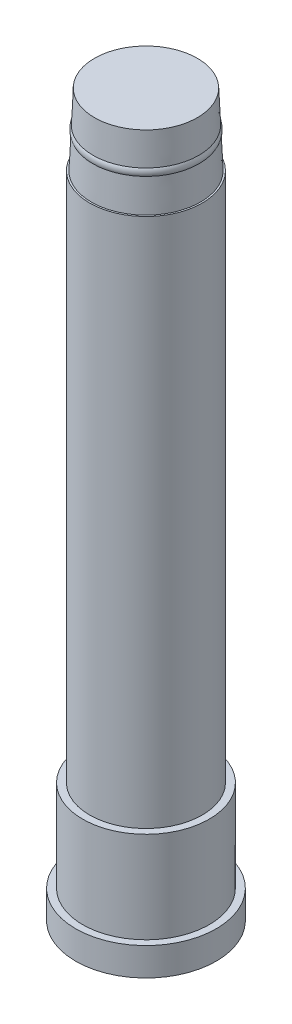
ISO-10303-21;
HEADER;
FILE_DESCRIPTION(('STEP AP214'),'2;1');
FILE_NAME('part.step','',(''),(''),'','','');
FILE_SCHEMA(('AUTOMOTIVE_DESIGN { 1 0 10303 214 1 1 1 1 }'));
ENDSEC;
DATA;
#1=APPLICATION_CONTEXT('core data for automotive mechanical design processes');
#2=APPLICATION_PROTOCOL_DEFINITION('international standard','automotive_design',2000,#1);
#3=PRODUCT_CONTEXT('',#1,'mechanical');
#4=PRODUCT('Part','Part','',(#3));
#5=PRODUCT_RELATED_PRODUCT_CATEGORY('part','',(#4));
#6=PRODUCT_DEFINITION_FORMATION('','',#4);
#7=PRODUCT_DEFINITION_CONTEXT('part definition',#1,'design');
#8=PRODUCT_DEFINITION('design','',#6,#7);
#9=PRODUCT_DEFINITION_SHAPE('','',#8);
#10=(LENGTH_UNIT() NAMED_UNIT(*) SI_UNIT(.MILLI.,.METRE.));
#11=(NAMED_UNIT(*) PLANE_ANGLE_UNIT() SI_UNIT($,.RADIAN.));
#12=(NAMED_UNIT(*) SI_UNIT($,.STERADIAN.) SOLID_ANGLE_UNIT());
#13=UNCERTAINTY_MEASURE_WITH_UNIT(LENGTH_MEASURE(1.E-05),#10,'distance_accuracy_value','');
#14=(GEOMETRIC_REPRESENTATION_CONTEXT(3) GLOBAL_UNCERTAINTY_ASSIGNED_CONTEXT((#13)) GLOBAL_UNIT_ASSIGNED_CONTEXT((#10,
#11,#12)) REPRESENTATION_CONTEXT('',''));
#15=CARTESIAN_POINT('',(0.,0.,0.));
#16=DIRECTION('',(0.,0.,1.));
#17=DIRECTION('',(1.,0.,0.));
#18=AXIS2_PLACEMENT_3D('',#15,#16,#17);
#19=CARTESIAN_POINT('',(0.,49.4323076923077,0.));
#20=DIRECTION('',(0.,1.,0.));
#21=DIRECTION('',(0.,0.,1.));
#22=AXIS2_PLACEMENT_3D('',#19,#20,#21);
#23=CYLINDRICAL_SURFACE('',#22,7.99999999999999);
#24=CARTESIAN_POINT('',(0.,17.,0.));
#25=DIRECTION('',(0.,1.,0.));
#26=DIRECTION('',(0.,0.,1.));
#27=AXIS2_PLACEMENT_3D('',#24,#25,#26);
#28=CIRCLE('',#27,7.99999999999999);
#29=CARTESIAN_POINT('',(0.,17.,7.99999999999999));
#30=VERTEX_POINT('',#29);
#31=EDGE_CURVE('E10',#30,#30,#28,.F.);
#32=ORIENTED_EDGE('',*,*,#31,.F.);
#33=EDGE_LOOP('',(#32));
#34=FACE_BOUND('',#33,.T.);
#35=CARTESIAN_POINT('',(0.,92.383,0.));
#36=DIRECTION('',(0.,1.,0.));
#37=DIRECTION('',(0.,0.,1.));
#38=AXIS2_PLACEMENT_3D('',#35,#36,#37);
#39=CIRCLE('',#38,7.99999999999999);
#40=CARTESIAN_POINT('',(0.,92.383,7.99999999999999));
#41=VERTEX_POINT('',#40);
#42=EDGE_CURVE('E48',#41,#41,#39,.F.);
#43=ORIENTED_EDGE('',*,*,#42,.T.);
#44=EDGE_LOOP('',(#43));
#45=FACE_BOUND('',#44,.T.);
#46=ADVANCED_FACE('F32',(#34,#45),#23,.T.);
#47=CARTESIAN_POINT('',(0.,92.383,9.671));
#48=DIRECTION('',(0.,1.,0.));
#49=DIRECTION('',(1.,0.,0.));
#50=AXIS2_PLACEMENT_3D('',#47,#48,#49);
#51=PLANE('',#50);
#52=ORIENTED_EDGE('',*,*,#42,.F.);
#53=EDGE_LOOP('',(#52));
#54=FACE_BOUND('',#53,.T.);
#55=CARTESIAN_POINT('',(0.,92.383,0.));
#56=DIRECTION('',(0.,-1.,0.));
#57=DIRECTION('',(-1.,0.,0.));
#58=AXIS2_PLACEMENT_3D('',#55,#56,#57);
#59=CIRCLE('',#58,7.76225);
#60=CARTESIAN_POINT('',(-7.76225,92.383,0.));
#61=VERTEX_POINT('',#60);
#62=EDGE_CURVE('E52',#61,#61,#59,.T.);
#63=ORIENTED_EDGE('',*,*,#62,.T.);
#64=EDGE_LOOP('',(#63));
#65=FACE_BOUND('',#64,.T.);
#66=ADVANCED_FACE('F94',(#54,#65),#51,.T.);
#67=CARTESIAN_POINT('',(0.,92.383,0.));
#68=DIRECTION('',(0.,-1.,0.));
#69=DIRECTION('',(-1.,0.,0.));
#70=AXIS2_PLACEMENT_3D('',#67,#68,#69);
#71=CONICAL_SURFACE('',#70,7.76225,0.0436332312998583);
#72=CARTESIAN_POINT('',(0.,97.0101830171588,0.));
#73=DIRECTION('',(0.,1.,0.));
#74=DIRECTION('',(1.,0.,0.));
#75=AXIS2_PLACEMENT_3D('',#72,#73,#74);
#76=CIRCLE('',#75,7.56022282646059);
#77=CARTESIAN_POINT('',(7.56022282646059,97.0101830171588,0.));
#78=VERTEX_POINT('',#77);
#79=EDGE_CURVE('E60',#78,#78,#76,.T.);
#80=ORIENTED_EDGE('',*,*,#79,.F.);
#81=EDGE_LOOP('',(#80));
#82=FACE_BOUND('',#81,.T.);
#83=ORIENTED_EDGE('',*,*,#62,.F.);
#84=EDGE_LOOP('',(#83));
#85=FACE_BOUND('',#84,.T.);
#86=ADVANCED_FACE('F99',(#82,#85),#71,.T.);
#87=CARTESIAN_POINT('',(0.,97.473,0.));
#88=DIRECTION('',(0.,1.,0.));
#89=DIRECTION('',(1.,0.,0.));
#90=AXIS2_PLACEMENT_3D('',#87,#88,#89);
#91=TOROIDAL_SURFACE('',#90,6.65351204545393,1.018);
#92=ORIENTED_EDGE('',*,*,#79,.T.);
#93=EDGE_LOOP('',(#92));
#94=FACE_BOUND('',#93,.T.);
#95=CARTESIAN_POINT('',(0.,98.0130808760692,0.));
#96=DIRECTION('',(0.,1.,0.));
#97=DIRECTION('',(1.,0.,0.));
#98=AXIS2_PLACEMENT_3D('',#95,#96,#97);
#99=CIRCLE('',#98,7.51643536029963);
#100=CARTESIAN_POINT('',(7.51643536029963,98.0130808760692,0.));
#101=VERTEX_POINT('',#100);
#102=EDGE_CURVE('E65',#101,#101,#99,.T.);
#103=ORIENTED_EDGE('',*,*,#102,.F.);
#104=EDGE_LOOP('',(#103));
#105=FACE_BOUND('',#104,.T.);
#106=ADVANCED_FACE('F105',(#94,#105),#91,.T.);
#107=CARTESIAN_POINT('',(0.,102.563,7.31778160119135));
#108=DIRECTION('',(0.,1.,0.));
#109=DIRECTION('',(1.,0.,0.));
#110=AXIS2_PLACEMENT_3D('',#107,#108,#109);
#111=PLANE('',#110);
#112=CARTESIAN_POINT('',(0.,102.563,0.));
#113=DIRECTION('',(0.,-1.,0.));
#114=DIRECTION('',(-1.,0.,0.));
#115=AXIS2_PLACEMENT_3D('',#112,#113,#114);
#116=CIRCLE('',#115,7.31778160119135);
#117=CARTESIAN_POINT('',(-7.31778160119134,102.563,0.));
#118=VERTEX_POINT('',#117);
#119=EDGE_CURVE('E56',#118,#118,#116,.T.);
#120=ORIENTED_EDGE('',*,*,#119,.F.);
#121=EDGE_LOOP('',(#120));
#122=FACE_BOUND('',#121,.T.);
#123=ADVANCED_FACE('F107',(#122),#111,.T.);
#124=ORIENTED_EDGE('',*,*,#102,.T.);
#125=EDGE_LOOP('',(#124));
#126=FACE_BOUND('',#125,.T.);
#127=ORIENTED_EDGE('',*,*,#119,.T.);
#128=EDGE_LOOP('',(#127));
#129=FACE_BOUND('',#128,.T.);
#130=ADVANCED_FACE('F80',(#126,#129),#71,.T.);
#131=CARTESIAN_POINT('',(0.,17.,0.));
#132=DIRECTION('',(0.,-1.,0.));
#133=DIRECTION('',(0.,0.,-1.));
#134=AXIS2_PLACEMENT_3D('',#131,#132,#133);
#135=CYLINDRICAL_SURFACE('',#134,9.);
#136=CARTESIAN_POINT('',(0.,17.,0.));
#137=DIRECTION('',(0.,1.,0.));
#138=DIRECTION('',(0.,0.,1.));
#139=AXIS2_PLACEMENT_3D('',#136,#137,#138);
#140=CIRCLE('',#139,9.);
#141=CARTESIAN_POINT('',(0.,17.,-9.));
#142=VERTEX_POINT('',#141);
#143=EDGE_CURVE('E68',#142,#142,#140,.T.);
#144=CARTESIAN_POINT('',(0.,4.,0.));
#145=DIRECTION('',(0.,1.,0.));
#146=DIRECTION('',(0.,0.,1.));
#147=AXIS2_PLACEMENT_3D('',#144,#145,#146);
#148=CIRCLE('',#147,9.);
#149=CARTESIAN_POINT('',(0.,4.,-9.));
#150=VERTEX_POINT('',#149);
#151=EDGE_CURVE('E69',#150,#150,#148,.T.);
#152=CARTESIAN_POINT('',(0.,17.,-9.));
#153=CARTESIAN_POINT('',(0.,16.8645833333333,-9.));
#154=CARTESIAN_POINT('',(0.,16.7291666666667,-9.));
#155=CARTESIAN_POINT('',(0.,16.4583333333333,-9.));
#156=CARTESIAN_POINT('',(0.,16.3229166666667,-9.));
#157=CARTESIAN_POINT('',(0.,16.0520833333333,-9.));
#158=CARTESIAN_POINT('',(0.,15.9166666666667,-9.));
#159=CARTESIAN_POINT('',(0.,15.6458333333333,-9.));
#160=CARTESIAN_POINT('',(0.,15.5104166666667,-9.));
#161=CARTESIAN_POINT('',(0.,15.2395833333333,-9.));
#162=CARTESIAN_POINT('',(0.,15.1041666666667,-9.));
#163=CARTESIAN_POINT('',(0.,14.8333333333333,-9.));
#164=CARTESIAN_POINT('',(0.,14.6979166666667,-9.));
#165=CARTESIAN_POINT('',(0.,14.4270833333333,-9.));
#166=CARTESIAN_POINT('',(0.,14.2916666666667,-9.));
#167=CARTESIAN_POINT('',(0.,14.0208333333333,-9.));
#168=CARTESIAN_POINT('',(0.,13.8854166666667,-9.));
#169=CARTESIAN_POINT('',(0.,13.6145833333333,-9.));
#170=CARTESIAN_POINT('',(0.,13.4791666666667,-9.));
#171=CARTESIAN_POINT('',(0.,13.2083333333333,-9.));
#172=CARTESIAN_POINT('',(0.,13.0729166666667,-9.));
#173=CARTESIAN_POINT('',(0.,12.8020833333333,-9.));
#174=CARTESIAN_POINT('',(0.,12.6666666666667,-9.));
#175=CARTESIAN_POINT('',(0.,12.3958333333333,-9.));
#176=CARTESIAN_POINT('',(0.,12.2604166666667,-9.));
#177=CARTESIAN_POINT('',(0.,11.9895833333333,-9.));
#178=CARTESIAN_POINT('',(0.,11.8541666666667,-9.));
#179=CARTESIAN_POINT('',(0.,11.5833333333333,-9.));
#180=CARTESIAN_POINT('',(0.,11.4479166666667,-9.));
#181=CARTESIAN_POINT('',(0.,11.1770833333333,-9.));
#182=CARTESIAN_POINT('',(0.,11.0416666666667,-9.));
#183=CARTESIAN_POINT('',(0.,10.7708333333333,-9.));
#184=CARTESIAN_POINT('',(0.,10.6354166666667,-9.));
#185=CARTESIAN_POINT('',(0.,10.3645833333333,-9.));
#186=CARTESIAN_POINT('',(0.,10.2291666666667,-9.));
#187=CARTESIAN_POINT('',(0.,9.95833333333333,-9.));
#188=CARTESIAN_POINT('',(0.,9.82291666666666,-9.));
#189=CARTESIAN_POINT('',(0.,9.55208333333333,-9.));
#190=CARTESIAN_POINT('',(0.,9.41666666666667,-9.));
#191=CARTESIAN_POINT('',(0.,9.14583333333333,-9.));
#192=CARTESIAN_POINT('',(0.,9.01041666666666,-9.));
#193=CARTESIAN_POINT('',(0.,8.73958333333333,-9.));
#194=CARTESIAN_POINT('',(0.,8.60416666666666,-9.));
#195=CARTESIAN_POINT('',(0.,8.33333333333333,-9.));
#196=CARTESIAN_POINT('',(0.,8.19791666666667,-9.));
#197=CARTESIAN_POINT('',(0.,7.92708333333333,-9.));
#198=CARTESIAN_POINT('',(0.,7.79166666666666,-9.));
#199=CARTESIAN_POINT('',(0.,7.52083333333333,-9.));
#200=CARTESIAN_POINT('',(0.,7.38541666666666,-9.));
#201=CARTESIAN_POINT('',(0.,7.11458333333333,-9.));
#202=CARTESIAN_POINT('',(0.,6.97916666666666,-9.));
#203=CARTESIAN_POINT('',(0.,6.70833333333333,-9.));
#204=CARTESIAN_POINT('',(0.,6.57291666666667,-9.));
#205=CARTESIAN_POINT('',(0.,6.30208333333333,-9.));
#206=CARTESIAN_POINT('',(0.,6.16666666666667,-9.));
#207=CARTESIAN_POINT('',(0.,5.89583333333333,-9.));
#208=CARTESIAN_POINT('',(0.,5.76041666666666,-9.));
#209=CARTESIAN_POINT('',(0.,5.48958333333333,-9.));
#210=CARTESIAN_POINT('',(0.,5.35416666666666,-9.));
#211=CARTESIAN_POINT('',(0.,5.08333333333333,-9.));
#212=CARTESIAN_POINT('',(0.,4.94791666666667,-9.));
#213=CARTESIAN_POINT('',(0.,4.67708333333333,-9.));
#214=CARTESIAN_POINT('',(0.,4.54166666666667,-9.));
#215=CARTESIAN_POINT('',(0.,4.27083333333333,-9.));
#216=CARTESIAN_POINT('',(0.,4.13541666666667,-9.));
#217=CARTESIAN_POINT('',(0.,4.,-9.));
#218=B_SPLINE_CURVE_WITH_KNOTS('',3,(#152,#153,#154,#155,#156,#157,#158,#159,#160,#161,#162,
#163,#164,#165,#166,#167,#168,#169,#170,#171,#172,#173,#174,#175,#176,#177,#178,#179,#180,#181,
#182,#183,#184,#185,#186,#187,#188,#189,#190,#191,#192,#193,#194,#195,#196,#197,#198,#199,#200,
#201,#202,#203,#204,#205,#206,#207,#208,#209,#210,#211,#212,#213,#214,#215,#216,#217),
.UNSPECIFIED.,.F.,.F.,(4,2,2,2,2,2,2,2,2,2,2,2,2,2,2,2,2,2,2,2,2,2,2,2,2,2,2,2,2,2,2,2,4),(0.,
0.406249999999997,0.812499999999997,1.21875,1.625,2.03125,2.4375,2.84375,3.25,3.65625,4.0625,
4.46875,4.875,5.28125,5.6875,6.09375,6.5,6.90625,7.3125,7.71875,8.125,8.53124999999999,8.9375,
9.34375,9.75,10.15625,10.5625,10.96875,11.375,11.78125,12.1875,12.59375,13.),.UNSPECIFIED.);
#219=EDGE_CURVE('BSEAM77',#142,#150,#218,.T.);
#220=ORIENTED_EDGE('',*,*,#143,.F.);
#221=ORIENTED_EDGE('',*,*,#151,.T.);
#222=ORIENTED_EDGE('',*,*,#219,.T.);
#223=ORIENTED_EDGE('',*,*,#219,.F.);
#224=EDGE_LOOP('',(#220,#222,#221,#223));
#225=FACE_BOUND('',#224,.T.);
#226=ADVANCED_FACE('F77',(#225),#135,.T.);
#227=CARTESIAN_POINT('',(0.,17.,0.));
#228=DIRECTION('',(0.,1.,0.));
#229=DIRECTION('',(0.,0.,1.));
#230=AXIS2_PLACEMENT_3D('',#227,#228,#229);
#231=PLANE('',#230);
#232=ORIENTED_EDGE('',*,*,#31,.T.);
#233=EDGE_LOOP('',(#232));
#234=FACE_BOUND('',#233,.T.);
#235=ORIENTED_EDGE('',*,*,#143,.T.);
#236=EDGE_LOOP('',(#235));
#237=FACE_BOUND('',#236,.T.);
#238=ADVANCED_FACE('F75',(#234,#237),#231,.T.);
#239=CARTESIAN_POINT('',(0.,0.,0.));
#240=DIRECTION('',(0.,-1.,0.));
#241=DIRECTION('',(0.,0.,-1.));
#242=AXIS2_PLACEMENT_3D('',#239,#240,#241);
#243=PLANE('',#242);
#244=CARTESIAN_POINT('',(0.,0.,0.));
#245=DIRECTION('',(0.,1.,0.));
#246=DIRECTION('',(0.,0.,1.));
#247=AXIS2_PLACEMENT_3D('',#244,#245,#246);
#248=CIRCLE('',#247,9.99999999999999);
#249=CARTESIAN_POINT('',(0.,0.,9.99999999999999));
#250=VERTEX_POINT('',#249);
#251=EDGE_CURVE('E39',#250,#250,#248,.T.);
#252=ORIENTED_EDGE('',*,*,#251,.F.);
#253=EDGE_LOOP('',(#252));
#254=FACE_BOUND('',#253,.T.);
#255=ADVANCED_FACE('F34',(#254),#243,.T.);
#256=CARTESIAN_POINT('',(0.,49.4323076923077,0.));
#257=DIRECTION('',(0.,1.,0.));
#258=DIRECTION('',(0.,0.,1.));
#259=AXIS2_PLACEMENT_3D('',#256,#257,#258);
#260=CYLINDRICAL_SURFACE('',#259,9.99999999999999);
#261=ORIENTED_EDGE('',*,*,#251,.T.);
#262=EDGE_LOOP('',(#261));
#263=FACE_BOUND('',#262,.T.);
#264=CARTESIAN_POINT('',(0.,4.,0.));
#265=DIRECTION('',(0.,1.,0.));
#266=DIRECTION('',(0.,0.,1.));
#267=AXIS2_PLACEMENT_3D('',#264,#265,#266);
#268=CIRCLE('',#267,9.99999999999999);
#269=CARTESIAN_POINT('',(0.,4.,9.99999999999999));
#270=VERTEX_POINT('',#269);
#271=EDGE_CURVE('E43',#270,#270,#268,.T.);
#272=ORIENTED_EDGE('',*,*,#271,.F.);
#273=EDGE_LOOP('',(#272));
#274=FACE_BOUND('',#273,.T.);
#275=ADVANCED_FACE('F86',(#263,#274),#260,.T.);
#276=CARTESIAN_POINT('',(-9.99999999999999,4.,0.));
#277=DIRECTION('',(0.,1.,0.));
#278=DIRECTION('',(0.,0.,1.));
#279=AXIS2_PLACEMENT_3D('',#276,#277,#278);
#280=PLANE('',#279);
#281=ORIENTED_EDGE('',*,*,#271,.T.);
#282=EDGE_LOOP('',(#281));
#283=FACE_BOUND('',#282,.T.);
#284=ORIENTED_EDGE('',*,*,#151,.F.);
#285=EDGE_LOOP('',(#284));
#286=FACE_BOUND('',#285,.T.);
#287=ADVANCED_FACE('F84',(#283,#286),#280,.T.);
#288=CLOSED_SHELL('',(#46,#66,#86,#106,#123,#130,#226,#238,#255,#275,#287));
#289=MANIFOLD_SOLID_BREP('B2',#288);
#290=ADVANCED_BREP_SHAPE_REPRESENTATION('',(#18,#289),#14);
#291=SHAPE_DEFINITION_REPRESENTATION(#9,#290);
ENDSEC;
END-ISO-10303-21;
